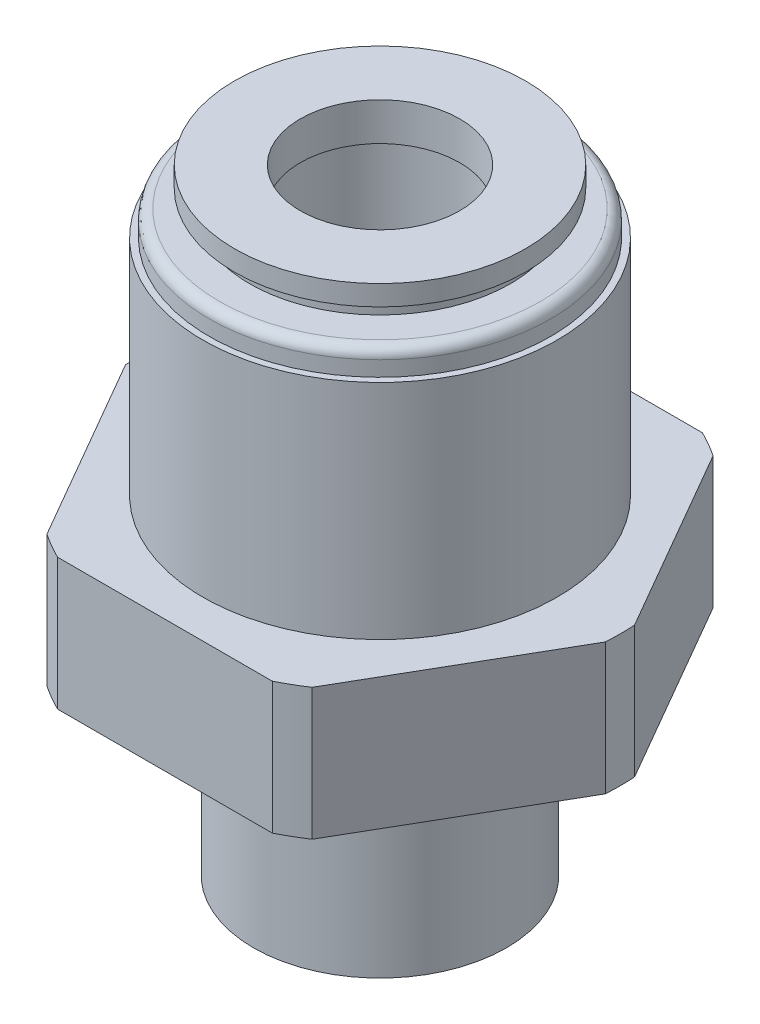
ISO-10303-21;
HEADER;
FILE_DESCRIPTION(('STEP AP214'),'2;1');
FILE_NAME('part.step','',(''),(''),'','','');
FILE_SCHEMA(('AUTOMOTIVE_DESIGN { 1 0 10303 214 1 1 1 1 }'));
ENDSEC;
DATA;
#1=APPLICATION_CONTEXT('core data for automotive mechanical design processes');
#2=APPLICATION_PROTOCOL_DEFINITION('international standard','automotive_design',2000,#1);
#3=PRODUCT_CONTEXT('',#1,'mechanical');
#4=PRODUCT('Part','Part','',(#3));
#5=PRODUCT_RELATED_PRODUCT_CATEGORY('part','',(#4));
#6=PRODUCT_DEFINITION_FORMATION('','',#4);
#7=PRODUCT_DEFINITION_CONTEXT('part definition',#1,'design');
#8=PRODUCT_DEFINITION('design','',#6,#7);
#9=PRODUCT_DEFINITION_SHAPE('','',#8);
#10=(LENGTH_UNIT() NAMED_UNIT(*) SI_UNIT(.MILLI.,.METRE.));
#11=(NAMED_UNIT(*) PLANE_ANGLE_UNIT() SI_UNIT($,.RADIAN.));
#12=(NAMED_UNIT(*) SI_UNIT($,.STERADIAN.) SOLID_ANGLE_UNIT());
#13=UNCERTAINTY_MEASURE_WITH_UNIT(LENGTH_MEASURE(1.E-05),#10,'distance_accuracy_value','');
#14=(GEOMETRIC_REPRESENTATION_CONTEXT(3) GLOBAL_UNCERTAINTY_ASSIGNED_CONTEXT((#13)) GLOBAL_UNIT_ASSIGNED_CONTEXT((#10,
#11,#12)) REPRESENTATION_CONTEXT('',''));
#15=CARTESIAN_POINT('',(0.,0.,0.));
#16=DIRECTION('',(0.,0.,1.));
#17=DIRECTION('',(1.,0.,0.));
#18=AXIS2_PLACEMENT_3D('',#15,#16,#17);
#19=CARTESIAN_POINT('',(0.,11.4,0.));
#20=DIRECTION('',(0.,-1.,0.));
#21=DIRECTION('',(0.,0.,-1.));
#22=AXIS2_PLACEMENT_3D('',#19,#20,#21);
#23=PLANE('',#22);
#24=CARTESIAN_POINT('',(0.,11.4,0.));
#25=DIRECTION('',(0.,-1.,0.));
#26=DIRECTION('',(0.,0.,-1.));
#27=AXIS2_PLACEMENT_3D('',#24,#25,#26);
#28=CIRCLE('',#27,3.15);
#29=CARTESIAN_POINT('',(0.,11.4,-3.15));
#30=VERTEX_POINT('',#29);
#31=EDGE_CURVE('P0_E259',#30,#30,#28,.F.);
#32=ORIENTED_EDGE('',*,*,#31,.T.);
#33=EDGE_LOOP('',(#32));
#34=FACE_BOUND('',#33,.T.);
#35=CARTESIAN_POINT('',(0.,11.4,0.));
#36=DIRECTION('',(0.,-1.,0.));
#37=DIRECTION('',(0.,0.,-1.));
#38=AXIS2_PLACEMENT_3D('',#35,#36,#37);
#39=CIRCLE('',#38,3.25);
#40=CARTESIAN_POINT('',(0.,11.4,-3.25));
#41=VERTEX_POINT('',#40);
#42=EDGE_CURVE('P0_E256',#41,#41,#39,.T.);
#43=ORIENTED_EDGE('',*,*,#42,.T.);
#44=EDGE_LOOP('',(#43));
#45=FACE_BOUND('',#44,.T.);
#46=ADVANCED_FACE('P0_F17',(#34,#45),#23,.T.);
#47=CARTESIAN_POINT('',(0.,12.975,0.));
#48=DIRECTION('',(0.,-1.,0.));
#49=DIRECTION('',(0.,0.,-1.));
#50=AXIS2_PLACEMENT_3D('',#47,#48,#49);
#51=CYLINDRICAL_SURFACE('',#50,3.15);
#52=ORIENTED_EDGE('',*,*,#31,.F.);
#53=EDGE_LOOP('',(#52));
#54=FACE_BOUND('',#53,.T.);
#55=CARTESIAN_POINT('',(0.,12.9,0.));
#56=DIRECTION('',(0.,-1.,0.));
#57=DIRECTION('',(0.,0.,-1.));
#58=AXIS2_PLACEMENT_3D('',#55,#56,#57);
#59=CIRCLE('',#58,3.15);
#60=CARTESIAN_POINT('',(0.,12.9,-3.15));
#61=VERTEX_POINT('',#60);
#62=EDGE_CURVE('P0_E205',#61,#61,#59,.F.);
#63=ORIENTED_EDGE('',*,*,#62,.T.);
#64=EDGE_LOOP('',(#63));
#65=FACE_BOUND('',#64,.T.);
#66=ADVANCED_FACE('P0_F331',(#54,#65),#51,.F.);
#67=CARTESIAN_POINT('',(0.,12.54,0.));
#68=DIRECTION('',(0.,-1.,0.));
#69=DIRECTION('',(0.,0.,-1.));
#70=AXIS2_PLACEMENT_3D('',#67,#68,#69);
#71=CYLINDRICAL_SURFACE('',#70,3.25);
#72=CARTESIAN_POINT('',(0.,1.28686935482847,0.));
#73=DIRECTION('',(0.,-1.,0.));
#74=DIRECTION('',(-1.,0.,0.));
#75=AXIS2_PLACEMENT_3D('',#72,#73,#74);
#76=CIRCLE('',#75,3.25000000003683);
#77=CARTESIAN_POINT('',(-3.25000000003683,1.28686935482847,0.));
#78=VERTEX_POINT('',#77);
#79=EDGE_CURVE('P0_E203',#78,#78,#76,.T.);
#80=ORIENTED_EDGE('',*,*,#79,.T.);
#81=EDGE_LOOP('',(#80));
#82=FACE_BOUND('',#81,.T.);
#83=ORIENTED_EDGE('',*,*,#42,.F.);
#84=EDGE_LOOP('',(#83));
#85=FACE_BOUND('',#84,.T.);
#86=ADVANCED_FACE('P0_F328',(#82,#85),#71,.F.);
#87=CARTESIAN_POINT('',(0.,12.9,0.));
#88=DIRECTION('',(0.,-1.,0.));
#89=DIRECTION('',(0.,0.,-1.));
#90=AXIS2_PLACEMENT_3D('',#87,#88,#89);
#91=PLANE('',#90);
#92=ORIENTED_EDGE('',*,*,#62,.F.);
#93=EDGE_LOOP('',(#92));
#94=FACE_BOUND('',#93,.T.);
#95=CARTESIAN_POINT('',(0.,12.9,0.));
#96=DIRECTION('',(0.,-1.,0.));
#97=DIRECTION('',(0.,0.,-1.));
#98=AXIS2_PLACEMENT_3D('',#95,#96,#97);
#99=CIRCLE('',#98,5.75);
#100=CARTESIAN_POINT('',(0.,12.9,-5.75));
#101=VERTEX_POINT('',#100);
#102=EDGE_CURVE('P0_E202',#101,#101,#99,.T.);
#103=ORIENTED_EDGE('',*,*,#102,.F.);
#104=EDGE_LOOP('',(#103));
#105=FACE_BOUND('',#104,.T.);
#106=ADVANCED_FACE('P0_F324',(#94,#105),#91,.F.);
#107=CARTESIAN_POINT('',(0.,0.600000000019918,0.));
#108=DIRECTION('',(0.,-1.,0.));
#109=DIRECTION('',(0.,0.,-1.));
#110=AXIS2_PLACEMENT_3D('',#107,#108,#109);
#111=CONICAL_SURFACE('',#110,3.5000000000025,0.349065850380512);
#112=CARTESIAN_POINT('',(0.,0.6,0.));
#113=DIRECTION('',(0.,-1.,0.));
#114=DIRECTION('',(0.,0.,-1.));
#115=AXIS2_PLACEMENT_3D('',#112,#113,#114);
#116=CIRCLE('',#115,3.5);
#117=CARTESIAN_POINT('',(0.,0.6,-3.5));
#118=VERTEX_POINT('',#117);
#119=EDGE_CURVE('P0_E193',#118,#118,#116,.T.);
#120=ORIENTED_EDGE('',*,*,#119,.T.);
#121=EDGE_LOOP('',(#120));
#122=FACE_BOUND('',#121,.T.);
#123=ORIENTED_EDGE('',*,*,#79,.F.);
#124=EDGE_LOOP('',(#123));
#125=FACE_BOUND('',#124,.T.);
#126=ADVANCED_FACE('P0_F320',(#122,#125),#111,.F.);
#127=CARTESIAN_POINT('',(0.,12.975,0.));
#128=DIRECTION('',(0.,-1.,0.));
#129=DIRECTION('',(0.,0.,-1.));
#130=AXIS2_PLACEMENT_3D('',#127,#128,#129);
#131=CYLINDRICAL_SURFACE('',#130,5.75);
#132=CARTESIAN_POINT('',(0.,12.1,0.));
#133=DIRECTION('',(0.,-1.,0.));
#134=DIRECTION('',(0.,0.,-1.));
#135=AXIS2_PLACEMENT_3D('',#132,#133,#134);
#136=CIRCLE('',#135,5.75);
#137=CARTESIAN_POINT('',(0.,12.1,-5.75));
#138=VERTEX_POINT('',#137);
#139=EDGE_CURVE('P0_E201',#138,#138,#136,.T.);
#140=ORIENTED_EDGE('',*,*,#139,.F.);
#141=EDGE_LOOP('',(#140));
#142=FACE_BOUND('',#141,.T.);
#143=ORIENTED_EDGE('',*,*,#102,.T.);
#144=EDGE_LOOP('',(#143));
#145=FACE_BOUND('',#144,.T.);
#146=ADVANCED_FACE('P0_F316',(#142,#145),#131,.T.);
#147=CARTESIAN_POINT('',(0.,12.54,0.));
#148=DIRECTION('',(0.,-1.,0.));
#149=DIRECTION('',(0.,0.,-1.));
#150=AXIS2_PLACEMENT_3D('',#147,#148,#149);
#151=CYLINDRICAL_SURFACE('',#150,3.5);
#152=CARTESIAN_POINT('',(0.,-11.4,0.));
#153=DIRECTION('',(0.,-1.,0.));
#154=DIRECTION('',(0.,0.,-1.));
#155=AXIS2_PLACEMENT_3D('',#152,#153,#154);
#156=CIRCLE('',#155,3.5);
#157=CARTESIAN_POINT('',(0.,-11.4,-3.5));
#158=VERTEX_POINT('',#157);
#159=EDGE_CURVE('P0_E247',#158,#158,#156,.F.);
#160=ORIENTED_EDGE('',*,*,#159,.F.);
#161=EDGE_LOOP('',(#160));
#162=FACE_BOUND('',#161,.T.);
#163=ORIENTED_EDGE('',*,*,#119,.F.);
#164=EDGE_LOOP('',(#163));
#165=FACE_BOUND('',#164,.T.);
#166=ADVANCED_FACE('P0_F312',(#162,#165),#151,.F.);
#167=CARTESIAN_POINT('',(0.,12.1,0.));
#168=DIRECTION('',(0.,-1.,0.));
#169=DIRECTION('',(0.,0.,-1.));
#170=AXIS2_PLACEMENT_3D('',#167,#168,#169);
#171=PLANE('',#170);
#172=CARTESIAN_POINT('',(0.,12.1,0.));
#173=DIRECTION('',(0.,-1.,0.));
#174=DIRECTION('',(0.,0.,-1.));
#175=AXIS2_PLACEMENT_3D('',#172,#173,#174);
#176=CIRCLE('',#175,5.15);
#177=CARTESIAN_POINT('',(0.,12.1,-5.15));
#178=VERTEX_POINT('',#177);
#179=EDGE_CURVE('P0_E244',#178,#178,#176,.T.);
#180=ORIENTED_EDGE('',*,*,#179,.F.);
#181=EDGE_LOOP('',(#180));
#182=FACE_BOUND('',#181,.T.);
#183=ORIENTED_EDGE('',*,*,#139,.T.);
#184=EDGE_LOOP('',(#183));
#185=FACE_BOUND('',#184,.T.);
#186=ADVANCED_FACE('P0_F308',(#182,#185),#171,.T.);
#187=CARTESIAN_POINT('',(0.,-11.4,0.));
#188=DIRECTION('',(0.,-1.,0.));
#189=DIRECTION('',(0.,0.,-1.));
#190=AXIS2_PLACEMENT_3D('',#187,#188,#189);
#191=PLANE('',#190);
#192=ORIENTED_EDGE('',*,*,#159,.T.);
#193=EDGE_LOOP('',(#192));
#194=FACE_BOUND('',#193,.T.);
#195=CARTESIAN_POINT('',(0.,-11.4,0.));
#196=DIRECTION('',(0.,-1.,0.));
#197=DIRECTION('',(0.,0.,-1.));
#198=AXIS2_PLACEMENT_3D('',#195,#196,#197);
#199=CIRCLE('',#198,4.25);
#200=CARTESIAN_POINT('',(0.,-11.4,-4.25));
#201=VERTEX_POINT('',#200);
#202=EDGE_CURVE('P0_E241',#201,#201,#199,.F.);
#203=ORIENTED_EDGE('',*,*,#202,.F.);
#204=EDGE_LOOP('',(#203));
#205=FACE_BOUND('',#204,.T.);
#206=ADVANCED_FACE('P0_F304',(#194,#205),#191,.T.);
#207=CARTESIAN_POINT('',(0.,12.975,0.));
#208=DIRECTION('',(0.,-1.,0.));
#209=DIRECTION('',(0.,0.,-1.));
#210=AXIS2_PLACEMENT_3D('',#207,#208,#209);
#211=CYLINDRICAL_SURFACE('',#210,5.15);
#212=ORIENTED_EDGE('',*,*,#179,.T.);
#213=EDGE_LOOP('',(#212));
#214=FACE_BOUND('',#213,.T.);
#215=CARTESIAN_POINT('',(0.,11.4,0.));
#216=DIRECTION('',(0.,-1.,0.));
#217=DIRECTION('',(0.,0.,-1.));
#218=AXIS2_PLACEMENT_3D('',#215,#216,#217);
#219=CIRCLE('',#218,5.15);
#220=CARTESIAN_POINT('',(0.,11.4,-5.15));
#221=VERTEX_POINT('',#220);
#222=EDGE_CURVE('P0_E113',#221,#221,#219,.F.);
#223=ORIENTED_EDGE('',*,*,#222,.T.);
#224=EDGE_LOOP('',(#223));
#225=FACE_BOUND('',#224,.T.);
#226=ADVANCED_FACE('P0_F300',(#214,#225),#211,.T.);
#227=CARTESIAN_POINT('',(0.,12.54,0.));
#228=DIRECTION('',(0.,-1.,0.));
#229=DIRECTION('',(0.,0.,-1.));
#230=AXIS2_PLACEMENT_3D('',#227,#228,#229);
#231=CYLINDRICAL_SURFACE('',#230,4.25);
#232=CARTESIAN_POINT('',(0.,-3.6,0.));
#233=DIRECTION('',(0.,-1.,0.));
#234=DIRECTION('',(0.,0.,-1.));
#235=AXIS2_PLACEMENT_3D('',#232,#233,#234);
#236=CIRCLE('',#235,4.25);
#237=CARTESIAN_POINT('',(0.,-3.6,-4.25));
#238=VERTEX_POINT('',#237);
#239=EDGE_CURVE('P0_E223',#238,#238,#236,.F.);
#240=ORIENTED_EDGE('',*,*,#239,.F.);
#241=EDGE_LOOP('',(#240));
#242=FACE_BOUND('',#241,.T.);
#243=ORIENTED_EDGE('',*,*,#202,.T.);
#244=EDGE_LOOP('',(#243));
#245=FACE_BOUND('',#244,.T.);
#246=ADVANCED_FACE('P0_F287',(#242,#245),#231,.T.);
#247=CARTESIAN_POINT('',(0.,11.4,0.));
#248=DIRECTION('',(0.,-1.,0.));
#249=DIRECTION('',(0.,0.,-1.));
#250=AXIS2_PLACEMENT_3D('',#247,#248,#249);
#251=PLANE('',#250);
#252=ORIENTED_EDGE('',*,*,#222,.F.);
#253=EDGE_LOOP('',(#252));
#254=FACE_BOUND('',#253,.T.);
#255=CARTESIAN_POINT('',(0.,11.4,0.));
#256=DIRECTION('',(0.,-1.,0.));
#257=DIRECTION('',(-1.,0.,0.));
#258=AXIS2_PLACEMENT_3D('',#255,#256,#257);
#259=CIRCLE('',#258,6.35);
#260=CARTESIAN_POINT('',(-6.35,11.4,0.));
#261=VERTEX_POINT('',#260);
#262=CARTESIAN_POINT('',(6.35,11.4,0.));
#263=VERTEX_POINT('',#262);
#264=EDGE_CURVE('P0_E266',#261,#263,#259,.T.);
#265=ORIENTED_EDGE('',*,*,#264,.F.);
#266=CARTESIAN_POINT('',(0.,11.4,0.));
#267=DIRECTION('',(0.,-1.,0.));
#268=DIRECTION('',(1.,0.,0.));
#269=AXIS2_PLACEMENT_3D('',#266,#267,#268);
#270=CIRCLE('',#269,6.35);
#271=EDGE_CURVE('P0_E215',#263,#261,#270,.T.);
#272=ORIENTED_EDGE('',*,*,#271,.F.);
#273=EDGE_LOOP('',(#265,#272));
#274=FACE_BOUND('',#273,.T.);
#275=ADVANCED_FACE('P0_F271',(#254,#274),#251,.F.);
#276=CARTESIAN_POINT('',(0.,12.54,0.));
#277=DIRECTION('',(0.,-1.,0.));
#278=DIRECTION('',(0.,0.,-1.));
#279=AXIS2_PLACEMENT_3D('',#276,#277,#278);
#280=CYLINDRICAL_SURFACE('',#279,9.5);
#281=CARTESIAN_POINT('',(0.,-3.6,0.));
#282=DIRECTION('',(0.,-1.,0.));
#283=DIRECTION('',(0.,0.,-1.));
#284=AXIS2_PLACEMENT_3D('',#281,#282,#283);
#285=CIRCLE('',#284,9.5);
#286=CARTESIAN_POINT('',(-4.24264068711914,-3.6,8.5));
#287=VERTEX_POINT('',#286);
#288=CARTESIAN_POINT('',(-5.23989558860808,-3.6,7.92423461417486));
#289=VERTEX_POINT('',#288);
#290=EDGE_CURVE('P0_E232',#287,#289,#285,.T.);
#291=ORIENTED_EDGE('',*,*,#290,.F.);
#292=DIRECTION('',(0.,1.,0.));
#293=VECTOR('',#292,1.);
#294=CARTESIAN_POINT('',(-4.242640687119,1.6,8.5));
#295=LINE('',#294,#293);
#296=CARTESIAN_POINT('',(-4.24264068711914,1.6,8.5));
#297=VERTEX_POINT('',#296);
#298=EDGE_CURVE('P0_E110',#287,#297,#295,.T.);
#299=ORIENTED_EDGE('',*,*,#298,.T.);
#300=CARTESIAN_POINT('',(0.,1.6,0.));
#301=DIRECTION('',(0.,-1.,0.));
#302=DIRECTION('',(0.,0.,-1.));
#303=AXIS2_PLACEMENT_3D('',#300,#301,#302);
#304=CIRCLE('',#303,9.5);
#305=CARTESIAN_POINT('',(-5.23989558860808,1.6,7.92423461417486));
#306=VERTEX_POINT('',#305);
#307=EDGE_CURVE('P0_E101',#297,#306,#304,.T.);
#308=ORIENTED_EDGE('',*,*,#307,.T.);
#309=DIRECTION('',(0.,1.,0.));
#310=VECTOR('',#309,1.);
#311=CARTESIAN_POINT('',(-5.239895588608,1.6,7.924234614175));
#312=LINE('',#311,#310);
#313=EDGE_CURVE('P0_E107',#306,#289,#312,.F.);
#314=ORIENTED_EDGE('',*,*,#313,.T.);
#315=EDGE_LOOP('',(#291,#299,#308,#314));
#316=FACE_BOUND('',#315,.T.);
#317=ADVANCED_FACE('P0_F106',(#316),#280,.T.);
#318=CARTESIAN_POINT('',(0.,12.54,0.));
#319=DIRECTION('',(0.,-1.,0.));
#320=DIRECTION('',(0.,0.,-1.));
#321=AXIS2_PLACEMENT_3D('',#318,#319,#320);
#322=CYLINDRICAL_SURFACE('',#321,9.5);
#323=DIRECTION('',(0.,1.,0.));
#324=VECTOR('',#323,1.);
#325=CARTESIAN_POINT('',(-9.482536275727,1.6,-0.5757653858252));
#326=LINE('',#325,#324);
#327=CARTESIAN_POINT('',(-9.48253627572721,1.6,-0.575765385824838));
#328=VERTEX_POINT('',#327);
#329=CARTESIAN_POINT('',(-9.48253627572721,-3.6,-0.57576538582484));
#330=VERTEX_POINT('',#329);
#331=EDGE_CURVE('P0_E158',#328,#330,#326,.F.);
#332=ORIENTED_EDGE('',*,*,#331,.T.);
#333=CARTESIAN_POINT('',(0.,-3.6,0.));
#334=DIRECTION('',(0.,-1.,0.));
#335=DIRECTION('',(0.,0.,-1.));
#336=AXIS2_PLACEMENT_3D('',#333,#334,#335);
#337=CIRCLE('',#336,9.5);
#338=CARTESIAN_POINT('',(-9.48253627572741,-3.6,0.575765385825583));
#339=VERTEX_POINT('',#338);
#340=EDGE_CURVE('P0_E230',#339,#330,#337,.T.);
#341=ORIENTED_EDGE('',*,*,#340,.F.);
#342=DIRECTION('',(0.,1.,0.));
#343=VECTOR('',#342,1.);
#344=CARTESIAN_POINT('',(-9.48253627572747,1.6,0.57576538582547));
#345=LINE('',#344,#343);
#346=CARTESIAN_POINT('',(-9.48253627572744,1.6,0.575765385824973));
#347=VERTEX_POINT('',#346);
#348=EDGE_CURVE('P0_E123',#339,#347,#345,.T.);
#349=ORIENTED_EDGE('',*,*,#348,.T.);
#350=CARTESIAN_POINT('',(0.,1.6,0.));
#351=DIRECTION('',(0.,-1.,0.));
#352=DIRECTION('',(0.,0.,-1.));
#353=AXIS2_PLACEMENT_3D('',#350,#351,#352);
#354=CIRCLE('',#353,9.5);
#355=EDGE_CURVE('P0_E112',#347,#328,#354,.T.);
#356=ORIENTED_EDGE('',*,*,#355,.T.);
#357=EDGE_LOOP('',(#332,#341,#349,#356));
#358=FACE_BOUND('',#357,.T.);
#359=ADVANCED_FACE('P0_F415',(#358),#322,.T.);
#360=CARTESIAN_POINT('',(0.,12.54,0.));
#361=DIRECTION('',(0.,-1.,0.));
#362=DIRECTION('',(0.,0.,-1.));
#363=AXIS2_PLACEMENT_3D('',#360,#361,#362);
#364=CYLINDRICAL_SURFACE('',#363,9.5);
#365=CARTESIAN_POINT('',(0.,-3.6,0.));
#366=DIRECTION('',(0.,-1.,0.));
#367=DIRECTION('',(0.,0.,-1.));
#368=AXIS2_PLACEMENT_3D('',#365,#366,#367);
#369=CIRCLE('',#368,9.5);
#370=CARTESIAN_POINT('',(-5.23989558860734,-3.6,-7.92423461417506));
#371=VERTEX_POINT('',#370);
#372=CARTESIAN_POINT('',(-4.24264068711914,-3.6,-8.5));
#373=VERTEX_POINT('',#372);
#374=EDGE_CURVE('P0_E228',#371,#373,#369,.T.);
#375=ORIENTED_EDGE('',*,*,#374,.F.);
#376=DIRECTION('',(0.,1.,0.));
#377=VECTOR('',#376,1.);
#378=CARTESIAN_POINT('',(-5.23989558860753,1.6,-7.92423461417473));
#379=LINE('',#378,#377);
#380=CARTESIAN_POINT('',(-5.23989558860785,1.6,-7.92423461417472));
#381=VERTEX_POINT('',#380);
#382=EDGE_CURVE('P0_E161',#371,#381,#379,.T.);
#383=ORIENTED_EDGE('',*,*,#382,.T.);
#384=CARTESIAN_POINT('',(0.,1.6,0.));
#385=DIRECTION('',(0.,-1.,0.));
#386=DIRECTION('',(0.,0.,-1.));
#387=AXIS2_PLACEMENT_3D('',#384,#385,#386);
#388=CIRCLE('',#387,9.5);
#389=CARTESIAN_POINT('',(-4.24264068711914,1.6,-8.5));
#390=VERTEX_POINT('',#389);
#391=EDGE_CURVE('P0_E236',#381,#390,#388,.T.);
#392=ORIENTED_EDGE('',*,*,#391,.T.);
#393=DIRECTION('',(0.,1.,0.));
#394=VECTOR('',#393,1.);
#395=CARTESIAN_POINT('',(-4.242640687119,1.6,-8.5));
#396=LINE('',#395,#394);
#397=EDGE_CURVE('P0_E151',#390,#373,#396,.F.);
#398=ORIENTED_EDGE('',*,*,#397,.T.);
#399=EDGE_LOOP('',(#375,#383,#392,#398));
#400=FACE_BOUND('',#399,.T.);
#401=ADVANCED_FACE('P0_F420',(#400),#364,.T.);
#402=CARTESIAN_POINT('',(0.,12.54,0.));
#403=DIRECTION('',(0.,-1.,0.));
#404=DIRECTION('',(0.,0.,-1.));
#405=AXIS2_PLACEMENT_3D('',#402,#403,#404);
#406=CYLINDRICAL_SURFACE('',#405,9.5);
#407=CARTESIAN_POINT('',(0.,-3.6,0.));
#408=DIRECTION('',(0.,-1.,0.));
#409=DIRECTION('',(0.,0.,-1.));
#410=AXIS2_PLACEMENT_3D('',#407,#408,#409);
#411=CIRCLE('',#410,9.5);
#412=CARTESIAN_POINT('',(4.24264068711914,-3.6,-8.5));
#413=VERTEX_POINT('',#412);
#414=CARTESIAN_POINT('',(5.23989558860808,-3.6,-7.92423461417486));
#415=VERTEX_POINT('',#414);
#416=EDGE_CURVE('P0_E226',#413,#415,#411,.T.);
#417=ORIENTED_EDGE('',*,*,#416,.F.);
#418=DIRECTION('',(0.,1.,0.));
#419=VECTOR('',#418,1.);
#420=CARTESIAN_POINT('',(4.242640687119,1.6,-8.5));
#421=LINE('',#420,#419);
#422=CARTESIAN_POINT('',(4.24264068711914,1.6,-8.5));
#423=VERTEX_POINT('',#422);
#424=EDGE_CURVE('P0_E154',#413,#423,#421,.T.);
#425=ORIENTED_EDGE('',*,*,#424,.T.);
#426=CARTESIAN_POINT('',(0.,1.6,0.));
#427=DIRECTION('',(0.,-1.,0.));
#428=DIRECTION('',(0.,0.,-1.));
#429=AXIS2_PLACEMENT_3D('',#426,#427,#428);
#430=CIRCLE('',#429,9.5);
#431=CARTESIAN_POINT('',(5.23989558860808,1.6,-7.92423461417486));
#432=VERTEX_POINT('',#431);
#433=EDGE_CURVE('P0_E234',#423,#432,#430,.T.);
#434=ORIENTED_EDGE('',*,*,#433,.T.);
#435=DIRECTION('',(0.,1.,0.));
#436=VECTOR('',#435,1.);
#437=CARTESIAN_POINT('',(5.239895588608,1.6,-7.924234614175));
#438=LINE('',#437,#436);
#439=EDGE_CURVE('P0_E144',#432,#415,#438,.F.);
#440=ORIENTED_EDGE('',*,*,#439,.T.);
#441=EDGE_LOOP('',(#417,#425,#434,#440));
#442=FACE_BOUND('',#441,.T.);
#443=ADVANCED_FACE('P0_F405',(#442),#406,.T.);
#444=CARTESIAN_POINT('',(0.,-3.6,0.));
#445=DIRECTION('',(0.,-1.,0.));
#446=DIRECTION('',(0.,0.,-1.));
#447=AXIS2_PLACEMENT_3D('',#444,#445,#446);
#448=PLANE('',#447);
#449=ORIENTED_EDGE('',*,*,#239,.T.);
#450=EDGE_LOOP('',(#449));
#451=FACE_BOUND('',#450,.T.);
#452=CARTESIAN_POINT('',(0.,-3.6,0.));
#453=DIRECTION('',(0.,-1.,0.));
#454=DIRECTION('',(0.,0.,-1.));
#455=AXIS2_PLACEMENT_3D('',#452,#453,#454);
#456=CIRCLE('',#455,9.5);
#457=CARTESIAN_POINT('',(4.24264068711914,-3.6,8.5));
#458=VERTEX_POINT('',#457);
#459=CARTESIAN_POINT('',(5.23989558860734,-3.6,7.92423461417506));
#460=VERTEX_POINT('',#459);
#461=EDGE_CURVE('P0_E220',#458,#460,#456,.F.);
#462=ORIENTED_EDGE('',*,*,#461,.F.);
#463=DIRECTION('',(-1.,0.,0.));
#464=VECTOR('',#463,1.);
#465=CARTESIAN_POINT('',(4.242640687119,-3.6,8.5));
#466=LINE('',#465,#464);
#467=EDGE_CURVE('P0_E169',#458,#287,#466,.T.);
#468=ORIENTED_EDGE('',*,*,#467,.T.);
#469=ORIENTED_EDGE('',*,*,#290,.T.);
#470=DIRECTION('',(-0.500000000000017,0.,-0.866025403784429));
#471=VECTOR('',#470,1.);
#472=CARTESIAN_POINT('',(-5.239895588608,-3.6,7.924234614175));
#473=LINE('',#472,#471);
#474=EDGE_CURVE('P0_E121',#289,#339,#473,.T.);
#475=ORIENTED_EDGE('',*,*,#474,.T.);
#476=ORIENTED_EDGE('',*,*,#340,.T.);
#477=DIRECTION('',(0.500000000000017,0.,-0.866025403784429));
#478=VECTOR('',#477,1.);
#479=CARTESIAN_POINT('',(-9.482536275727,-3.6,-0.5757653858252));
#480=LINE('',#479,#478);
#481=EDGE_CURVE('P0_E122',#330,#371,#480,.T.);
#482=ORIENTED_EDGE('',*,*,#481,.T.);
#483=ORIENTED_EDGE('',*,*,#374,.T.);
#484=DIRECTION('',(1.,0.,0.));
#485=VECTOR('',#484,1.);
#486=CARTESIAN_POINT('',(-4.242640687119,-3.6,-8.5));
#487=LINE('',#486,#485);
#488=EDGE_CURVE('P0_E157',#373,#413,#487,.T.);
#489=ORIENTED_EDGE('',*,*,#488,.T.);
#490=ORIENTED_EDGE('',*,*,#416,.T.);
#491=DIRECTION('',(0.500000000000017,0.,0.866025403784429));
#492=VECTOR('',#491,1.);
#493=CARTESIAN_POINT('',(5.239895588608,-3.6,-7.924234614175));
#494=LINE('',#493,#492);
#495=CARTESIAN_POINT('',(9.48253627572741,-3.6,-0.575765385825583));
#496=VERTEX_POINT('',#495);
#497=EDGE_CURVE('P0_E150',#415,#496,#494,.T.);
#498=ORIENTED_EDGE('',*,*,#497,.T.);
#499=CARTESIAN_POINT('',(0.,-3.6,0.));
#500=DIRECTION('',(0.,-1.,0.));
#501=DIRECTION('',(0.,0.,-1.));
#502=AXIS2_PLACEMENT_3D('',#499,#500,#501);
#503=CIRCLE('',#502,9.5);
#504=CARTESIAN_POINT('',(9.48253627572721,-3.6,0.57576538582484));
#505=VERTEX_POINT('',#504);
#506=EDGE_CURVE('P0_E216',#505,#496,#503,.F.);
#507=ORIENTED_EDGE('',*,*,#506,.F.);
#508=DIRECTION('',(-0.500000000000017,0.,0.866025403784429));
#509=VECTOR('',#508,1.);
#510=CARTESIAN_POINT('',(9.482536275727,-3.6,0.5757653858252));
#511=LINE('',#510,#509);
#512=EDGE_CURVE('P0_E143',#505,#460,#511,.T.);
#513=ORIENTED_EDGE('',*,*,#512,.T.);
#514=EDGE_LOOP('',(#462,#468,#469,#475,#476,#482,#483,#489,#490,#498,#507,#513));
#515=FACE_BOUND('',#514,.T.);
#516=ADVANCED_FACE('P0_F410',(#451,#515),#448,.T.);
#517=CARTESIAN_POINT('',(0.,12.54,0.));
#518=DIRECTION('',(0.,-1.,0.));
#519=DIRECTION('',(0.,0.,-1.));
#520=AXIS2_PLACEMENT_3D('',#517,#518,#519);
#521=CYLINDRICAL_SURFACE('',#520,9.5);
#522=CARTESIAN_POINT('',(0.,1.6,0.));
#523=DIRECTION('',(0.,-1.,0.));
#524=DIRECTION('',(0.,0.,-1.));
#525=AXIS2_PLACEMENT_3D('',#522,#523,#524);
#526=CIRCLE('',#525,9.5);
#527=CARTESIAN_POINT('',(5.23989558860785,1.6,7.92423461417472));
#528=VERTEX_POINT('',#527);
#529=CARTESIAN_POINT('',(4.24264068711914,1.6,8.5));
#530=VERTEX_POINT('',#529);
#531=EDGE_CURVE('P0_E37',#528,#530,#526,.T.);
#532=ORIENTED_EDGE('',*,*,#531,.T.);
#533=DIRECTION('',(0.,1.,0.));
#534=VECTOR('',#533,1.);
#535=CARTESIAN_POINT('',(4.242640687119,1.6,8.5));
#536=LINE('',#535,#534);
#537=EDGE_CURVE('P0_E165',#530,#458,#536,.F.);
#538=ORIENTED_EDGE('',*,*,#537,.T.);
#539=ORIENTED_EDGE('',*,*,#461,.T.);
#540=DIRECTION('',(0.,1.,0.));
#541=VECTOR('',#540,1.);
#542=CARTESIAN_POINT('',(5.23989558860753,1.6,7.92423461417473));
#543=LINE('',#542,#541);
#544=EDGE_CURVE('P0_E141',#460,#528,#543,.T.);
#545=ORIENTED_EDGE('',*,*,#544,.T.);
#546=EDGE_LOOP('',(#532,#538,#539,#545));
#547=FACE_BOUND('',#546,.T.);
#548=ADVANCED_FACE('P0_F387',(#547),#521,.T.);
#549=CARTESIAN_POINT('',(0.,12.54,0.));
#550=DIRECTION('',(0.,-1.,0.));
#551=DIRECTION('',(0.,0.,-1.));
#552=AXIS2_PLACEMENT_3D('',#549,#550,#551);
#553=CYLINDRICAL_SURFACE('',#552,9.5);
#554=DIRECTION('',(0.,1.,0.));
#555=VECTOR('',#554,1.);
#556=CARTESIAN_POINT('',(9.48253627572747,1.6,-0.57576538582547));
#557=LINE('',#556,#555);
#558=CARTESIAN_POINT('',(9.48253627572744,1.6,-0.575765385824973));
#559=VERTEX_POINT('',#558);
#560=EDGE_CURVE('P0_E147',#496,#559,#557,.T.);
#561=ORIENTED_EDGE('',*,*,#560,.T.);
#562=CARTESIAN_POINT('',(0.,1.6,0.));
#563=DIRECTION('',(0.,-1.,0.));
#564=DIRECTION('',(0.,0.,-1.));
#565=AXIS2_PLACEMENT_3D('',#562,#563,#564);
#566=CIRCLE('',#565,9.5);
#567=CARTESIAN_POINT('',(9.48253627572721,1.6,0.575765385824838));
#568=VERTEX_POINT('',#567);
#569=EDGE_CURVE('P0_E213',#559,#568,#566,.T.);
#570=ORIENTED_EDGE('',*,*,#569,.T.);
#571=DIRECTION('',(0.,1.,0.));
#572=VECTOR('',#571,1.);
#573=CARTESIAN_POINT('',(9.482536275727,1.6,0.5757653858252));
#574=LINE('',#573,#572);
#575=EDGE_CURVE('P0_E138',#568,#505,#574,.F.);
#576=ORIENTED_EDGE('',*,*,#575,.T.);
#577=ORIENTED_EDGE('',*,*,#506,.T.);
#578=EDGE_LOOP('',(#561,#570,#576,#577));
#579=FACE_BOUND('',#578,.T.);
#580=ADVANCED_FACE('P0_F181',(#579),#553,.T.);
#581=CARTESIAN_POINT('',(0.,11.,0.));
#582=DIRECTION('',(0.,-1.,0.));
#583=DIRECTION('',(-1.,0.,0.));
#584=AXIS2_PLACEMENT_3D('',#581,#582,#583);
#585=TOROIDAL_SURFACE('',#584,6.35,0.4);
#586=ORIENTED_EDGE('',*,*,#271,.T.);
#587=ORIENTED_EDGE('',*,*,#264,.T.);
#588=EDGE_LOOP('',(#586,#587));
#589=FACE_BOUND('',#588,.T.);
#590=CARTESIAN_POINT('',(0.,11.,0.));
#591=DIRECTION('',(0.,-1.,0.));
#592=DIRECTION('',(0.,0.,-1.));
#593=AXIS2_PLACEMENT_3D('',#590,#591,#592);
#594=CIRCLE('',#593,6.75);
#595=CARTESIAN_POINT('',(0.,11.,-6.75));
#596=VERTEX_POINT('',#595);
#597=EDGE_CURVE('P0_E134',#596,#596,#594,.T.);
#598=ORIENTED_EDGE('',*,*,#597,.F.);
#599=EDGE_LOOP('',(#598));
#600=FACE_BOUND('',#599,.T.);
#601=ADVANCED_FACE('P0_F175',(#589,#600),#585,.T.);
#602=CARTESIAN_POINT('',(4.242640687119,1.6,8.5));
#603=DIRECTION('',(0.,0.,-1.));
#604=DIRECTION('',(-1.,0.,0.));
#605=AXIS2_PLACEMENT_3D('',#602,#603,#604);
#606=PLANE('',#605);
#607=DIRECTION('',(1.,0.,0.));
#608=VECTOR('',#607,1.);
#609=CARTESIAN_POINT('',(0.,1.6,8.5));
#610=LINE('',#609,#608);
#611=EDGE_CURVE('P0_E129',#530,#297,#610,.F.);
#612=ORIENTED_EDGE('',*,*,#611,.T.);
#613=ORIENTED_EDGE('',*,*,#298,.F.);
#614=ORIENTED_EDGE('',*,*,#467,.F.);
#615=ORIENTED_EDGE('',*,*,#537,.F.);
#616=EDGE_LOOP('',(#612,#613,#614,#615));
#617=FACE_BOUND('',#616,.T.);
#618=ADVANCED_FACE('P0_F180',(#617),#606,.F.);
#619=CARTESIAN_POINT('',(-5.239895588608,1.6,7.924234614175));
#620=DIRECTION('',(0.866025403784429,0.,-0.500000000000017));
#621=DIRECTION('',(-0.500000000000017,0.,-0.866025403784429));
#622=AXIS2_PLACEMENT_3D('',#619,#620,#621);
#623=PLANE('',#622);
#624=DIRECTION('',(-0.499999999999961,0.,-0.866025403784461));
#625=VECTOR('',#624,1.);
#626=CARTESIAN_POINT('',(-5.239895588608,1.6,7.924234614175));
#627=LINE('',#626,#625);
#628=EDGE_CURVE('P0_E119',#306,#347,#627,.T.);
#629=ORIENTED_EDGE('',*,*,#628,.T.);
#630=ORIENTED_EDGE('',*,*,#348,.F.);
#631=ORIENTED_EDGE('',*,*,#474,.F.);
#632=ORIENTED_EDGE('',*,*,#313,.F.);
#633=EDGE_LOOP('',(#629,#630,#631,#632));
#634=FACE_BOUND('',#633,.T.);
#635=ADVANCED_FACE('P0_F117',(#634),#623,.F.);
#636=CARTESIAN_POINT('',(-9.482536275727,1.6,-0.5757653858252));
#637=DIRECTION('',(0.866025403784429,0.,0.500000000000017));
#638=DIRECTION('',(0.500000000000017,0.,-0.866025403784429));
#639=AXIS2_PLACEMENT_3D('',#636,#637,#638);
#640=PLANE('',#639);
#641=DIRECTION('',(0.499999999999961,0.,-0.866025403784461));
#642=VECTOR('',#641,1.);
#643=CARTESIAN_POINT('',(-9.482536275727,1.6,-0.5757653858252));
#644=LINE('',#643,#642);
#645=EDGE_CURVE('P0_E128',#328,#381,#644,.T.);
#646=ORIENTED_EDGE('',*,*,#645,.T.);
#647=ORIENTED_EDGE('',*,*,#382,.F.);
#648=ORIENTED_EDGE('',*,*,#481,.F.);
#649=ORIENTED_EDGE('',*,*,#331,.F.);
#650=EDGE_LOOP('',(#646,#647,#648,#649));
#651=FACE_BOUND('',#650,.T.);
#652=ADVANCED_FACE('P0_F372',(#651),#640,.F.);
#653=CARTESIAN_POINT('',(-4.242640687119,1.6,-8.5));
#654=DIRECTION('',(0.,0.,1.));
#655=DIRECTION('',(1.,0.,0.));
#656=AXIS2_PLACEMENT_3D('',#653,#654,#655);
#657=PLANE('',#656);
#658=DIRECTION('',(1.,0.,0.));
#659=VECTOR('',#658,1.);
#660=CARTESIAN_POINT('',(0.,1.6,-8.5));
#661=LINE('',#660,#659);
#662=EDGE_CURVE('P0_E132',#390,#423,#661,.T.);
#663=ORIENTED_EDGE('',*,*,#662,.T.);
#664=ORIENTED_EDGE('',*,*,#424,.F.);
#665=ORIENTED_EDGE('',*,*,#488,.F.);
#666=ORIENTED_EDGE('',*,*,#397,.F.);
#667=EDGE_LOOP('',(#663,#664,#665,#666));
#668=FACE_BOUND('',#667,.T.);
#669=ADVANCED_FACE('P0_F368',(#668),#657,.F.);
#670=CARTESIAN_POINT('',(5.239895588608,1.6,-7.924234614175));
#671=DIRECTION('',(-0.866025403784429,0.,0.500000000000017));
#672=DIRECTION('',(0.500000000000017,0.,0.866025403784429));
#673=AXIS2_PLACEMENT_3D('',#670,#671,#672);
#674=PLANE('',#673);
#675=DIRECTION('',(0.499999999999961,0.,0.866025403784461));
#676=VECTOR('',#675,1.);
#677=CARTESIAN_POINT('',(5.239895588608,1.6,-7.924234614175));
#678=LINE('',#677,#676);
#679=EDGE_CURVE('P0_E393',#432,#559,#678,.T.);
#680=ORIENTED_EDGE('',*,*,#679,.T.);
#681=ORIENTED_EDGE('',*,*,#560,.F.);
#682=ORIENTED_EDGE('',*,*,#497,.F.);
#683=ORIENTED_EDGE('',*,*,#439,.F.);
#684=EDGE_LOOP('',(#680,#681,#682,#683));
#685=FACE_BOUND('',#684,.T.);
#686=ADVANCED_FACE('P0_F364',(#685),#674,.F.);
#687=CARTESIAN_POINT('',(9.482536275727,1.6,0.5757653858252));
#688=DIRECTION('',(-0.866025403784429,0.,-0.500000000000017));
#689=DIRECTION('',(-0.500000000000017,0.,0.866025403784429));
#690=AXIS2_PLACEMENT_3D('',#687,#688,#689);
#691=PLANE('',#690);
#692=DIRECTION('',(-0.499999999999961,0.,0.866025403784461));
#693=VECTOR('',#692,1.);
#694=CARTESIAN_POINT('',(9.482536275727,1.6,0.5757653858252));
#695=LINE('',#694,#693);
#696=EDGE_CURVE('P0_E212',#568,#528,#695,.T.);
#697=ORIENTED_EDGE('',*,*,#696,.T.);
#698=ORIENTED_EDGE('',*,*,#544,.F.);
#699=ORIENTED_EDGE('',*,*,#512,.F.);
#700=ORIENTED_EDGE('',*,*,#575,.F.);
#701=EDGE_LOOP('',(#697,#698,#699,#700));
#702=FACE_BOUND('',#701,.T.);
#703=ADVANCED_FACE('P0_F360',(#702),#691,.F.);
#704=CARTESIAN_POINT('',(0.,12.54,0.));
#705=DIRECTION('',(0.,-1.,0.));
#706=DIRECTION('',(0.,0.,-1.));
#707=AXIS2_PLACEMENT_3D('',#704,#705,#706);
#708=CYLINDRICAL_SURFACE('',#707,6.75);
#709=ORIENTED_EDGE('',*,*,#597,.T.);
#710=EDGE_LOOP('',(#709));
#711=FACE_BOUND('',#710,.T.);
#712=CARTESIAN_POINT('',(0.,10.4,0.));
#713=DIRECTION('',(0.,-1.,0.));
#714=DIRECTION('',(0.,0.,-1.));
#715=AXIS2_PLACEMENT_3D('',#712,#713,#714);
#716=CIRCLE('',#715,6.75);
#717=CARTESIAN_POINT('',(0.,10.4,-6.75));
#718=VERTEX_POINT('',#717);
#719=EDGE_CURVE('P0_E209',#718,#718,#716,.F.);
#720=ORIENTED_EDGE('',*,*,#719,.T.);
#721=EDGE_LOOP('',(#720));
#722=FACE_BOUND('',#721,.T.);
#723=ADVANCED_FACE('P0_F356',(#711,#722),#708,.T.);
#724=CARTESIAN_POINT('',(0.,1.6,0.));
#725=DIRECTION('',(0.,-1.,0.));
#726=DIRECTION('',(0.,0.,-1.));
#727=AXIS2_PLACEMENT_3D('',#724,#725,#726);
#728=PLANE('',#727);
#729=CARTESIAN_POINT('',(0.,1.6,0.));
#730=DIRECTION('',(0.,-1.,0.));
#731=DIRECTION('',(0.,0.,-1.));
#732=AXIS2_PLACEMENT_3D('',#729,#730,#731);
#733=CIRCLE('',#732,7.);
#734=CARTESIAN_POINT('',(0.,1.6,-7.));
#735=VERTEX_POINT('',#734);
#736=EDGE_CURVE('P0_E28',#735,#735,#733,.F.);
#737=ORIENTED_EDGE('',*,*,#736,.F.);
#738=EDGE_LOOP('',(#737));
#739=FACE_BOUND('',#738,.T.);
#740=ORIENTED_EDGE('',*,*,#696,.F.);
#741=ORIENTED_EDGE('',*,*,#569,.F.);
#742=ORIENTED_EDGE('',*,*,#679,.F.);
#743=ORIENTED_EDGE('',*,*,#433,.F.);
#744=ORIENTED_EDGE('',*,*,#662,.F.);
#745=ORIENTED_EDGE('',*,*,#391,.F.);
#746=ORIENTED_EDGE('',*,*,#645,.F.);
#747=ORIENTED_EDGE('',*,*,#355,.F.);
#748=ORIENTED_EDGE('',*,*,#628,.F.);
#749=ORIENTED_EDGE('',*,*,#307,.F.);
#750=ORIENTED_EDGE('',*,*,#611,.F.);
#751=ORIENTED_EDGE('',*,*,#531,.F.);
#752=EDGE_LOOP('',(#740,#741,#742,#743,#744,#745,#746,#747,#748,#749,#750,#751));
#753=FACE_BOUND('',#752,.T.);
#754=ADVANCED_FACE('P0_F125',(#739,#753),#728,.F.);
#755=CARTESIAN_POINT('',(0.,10.4,0.));
#756=DIRECTION('',(0.,-1.,0.));
#757=DIRECTION('',(0.,0.,-1.));
#758=AXIS2_PLACEMENT_3D('',#755,#756,#757);
#759=PLANE('',#758);
#760=ORIENTED_EDGE('',*,*,#719,.F.);
#761=EDGE_LOOP('',(#760));
#762=FACE_BOUND('',#761,.T.);
#763=CARTESIAN_POINT('',(0.,10.4,0.));
#764=DIRECTION('',(0.,-1.,0.));
#765=DIRECTION('',(0.,0.,-1.));
#766=AXIS2_PLACEMENT_3D('',#763,#764,#765);
#767=CIRCLE('',#766,7.);
#768=CARTESIAN_POINT('',(0.,10.4,-7.));
#769=VERTEX_POINT('',#768);
#770=EDGE_CURVE('P0_E11',#769,#769,#767,.T.);
#771=ORIENTED_EDGE('',*,*,#770,.F.);
#772=EDGE_LOOP('',(#771));
#773=FACE_BOUND('',#772,.T.);
#774=ADVANCED_FACE('P0_F344',(#762,#773),#759,.F.);
#775=CARTESIAN_POINT('',(0.,12.54,0.));
#776=DIRECTION('',(0.,-1.,0.));
#777=DIRECTION('',(0.,0.,-1.));
#778=AXIS2_PLACEMENT_3D('',#775,#776,#777);
#779=CYLINDRICAL_SURFACE('',#778,7.);
#780=ORIENTED_EDGE('',*,*,#770,.T.);
#781=EDGE_LOOP('',(#780));
#782=FACE_BOUND('',#781,.T.);
#783=ORIENTED_EDGE('',*,*,#736,.T.);
#784=EDGE_LOOP('',(#783));
#785=FACE_BOUND('',#784,.T.);
#786=ADVANCED_FACE('P0_F342',(#782,#785),#779,.T.);
#787=CLOSED_SHELL('',(#46,#66,#86,#106,#126,#146,#166,#186,#206,#226,#246,#275,#317,#359,#401,
#443,#516,#548,#580,#601,#618,#635,#652,#669,#686,#703,#723,#754,#774,#786));
#788=MANIFOLD_SOLID_BREP('P0_B1',#787);
#789=CARTESIAN_POINT('',(0.,-11.4,0.));
#790=DIRECTION('',(0.,1.,0.));
#791=DIRECTION('',(0.,0.,1.));
#792=AXIS2_PLACEMENT_3D('',#789,#790,#791);
#793=CYLINDRICAL_SURFACE('',#792,5.);
#794=CARTESIAN_POINT('',(0.,-3.6,0.));
#795=DIRECTION('',(0.,1.,0.));
#796=DIRECTION('',(0.,0.,1.));
#797=AXIS2_PLACEMENT_3D('',#794,#795,#796);
#798=CIRCLE('',#797,5.);
#799=CARTESIAN_POINT('',(0.,-3.6,5.));
#800=VERTEX_POINT('',#799);
#801=EDGE_CURVE('P1_E16',#800,#800,#798,.F.);
#802=ORIENTED_EDGE('',*,*,#801,.T.);
#803=EDGE_LOOP('',(#802));
#804=FACE_BOUND('',#803,.T.);
#805=CARTESIAN_POINT('',(0.,-11.4,0.));
#806=DIRECTION('',(0.,1.,0.));
#807=DIRECTION('',(0.,0.,1.));
#808=AXIS2_PLACEMENT_3D('',#805,#806,#807);
#809=CIRCLE('',#808,5.);
#810=CARTESIAN_POINT('',(0.,-11.4,5.));
#811=VERTEX_POINT('',#810);
#812=EDGE_CURVE('P1_E10',#811,#811,#809,.T.);
#813=ORIENTED_EDGE('',*,*,#812,.T.);
#814=EDGE_LOOP('',(#813));
#815=FACE_BOUND('',#814,.T.);
#816=ADVANCED_FACE('P1_F15',(#804,#815),#793,.T.);
#817=OPEN_SHELL('',(#816));
#818=SHELL_BASED_SURFACE_MODEL('P1_B1',(#817));
#819=ADVANCED_BREP_SHAPE_REPRESENTATION('',(#18,#788),#14);
#820=MANIFOLD_SURFACE_SHAPE_REPRESENTATION('',(#18,#818),#14);
#821=SHAPE_REPRESENTATION('',(#18),#14);
#822=SHAPE_DEFINITION_REPRESENTATION(#9,#821);
#823=SHAPE_REPRESENTATION_RELATIONSHIP('','',#821,#819);
#824=SHAPE_REPRESENTATION_RELATIONSHIP('','',#821,#820);
ENDSEC;
END-ISO-10303-21;
